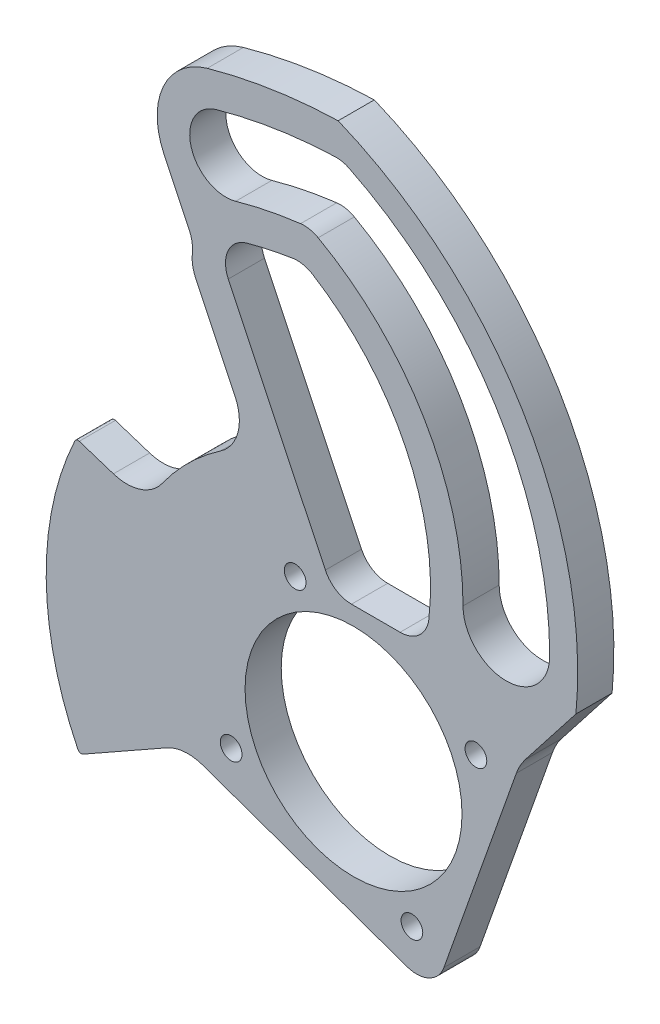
ISO-10303-21;
HEADER;
FILE_DESCRIPTION(('STEP AP214'),'2;1');
FILE_NAME('part.step','',(''),(''),'','','');
FILE_SCHEMA(('AUTOMOTIVE_DESIGN { 1 0 10303 214 1 1 1 1 }'));
ENDSEC;
DATA;
#1=APPLICATION_CONTEXT('core data for automotive mechanical design processes');
#2=APPLICATION_PROTOCOL_DEFINITION('international standard','automotive_design',2000,#1);
#3=PRODUCT_CONTEXT('',#1,'mechanical');
#4=PRODUCT('Part','Part','',(#3));
#5=PRODUCT_RELATED_PRODUCT_CATEGORY('part','',(#4));
#6=PRODUCT_DEFINITION_FORMATION('','',#4);
#7=PRODUCT_DEFINITION_CONTEXT('part definition',#1,'design');
#8=PRODUCT_DEFINITION('design','',#6,#7);
#9=PRODUCT_DEFINITION_SHAPE('','',#8);
#10=(LENGTH_UNIT() NAMED_UNIT(*) SI_UNIT(.MILLI.,.METRE.));
#11=(NAMED_UNIT(*) PLANE_ANGLE_UNIT() SI_UNIT($,.RADIAN.));
#12=(NAMED_UNIT(*) SI_UNIT($,.STERADIAN.) SOLID_ANGLE_UNIT());
#13=UNCERTAINTY_MEASURE_WITH_UNIT(LENGTH_MEASURE(1.E-05),#10,'distance_accuracy_value','');
#14=(GEOMETRIC_REPRESENTATION_CONTEXT(3) GLOBAL_UNCERTAINTY_ASSIGNED_CONTEXT((#13)) GLOBAL_UNIT_ASSIGNED_CONTEXT((#10,
#11,#12)) REPRESENTATION_CONTEXT('',''));
#15=CARTESIAN_POINT('',(0.,0.,0.));
#16=DIRECTION('',(0.,0.,1.));
#17=DIRECTION('',(1.,0.,0.));
#18=AXIS2_PLACEMENT_3D('',#15,#16,#17);
#19=CARTESIAN_POINT('',(-27.4137430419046,99.28487645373,10.));
#20=DIRECTION('',(0.,0.,-1.));
#21=DIRECTION('',(-1.,0.,0.));
#22=AXIS2_PLACEMENT_3D('',#19,#20,#21);
#23=CYLINDRICAL_SURFACE('',#22,8.);
#24=CARTESIAN_POINT('',(-27.4137430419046,99.28487645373,0.));
#25=DIRECTION('',(0.,0.,1.));
#26=DIRECTION('',(1.,0.,0.));
#27=AXIS2_PLACEMENT_3D('',#24,#25,#26);
#28=CIRCLE('',#27,8.);
#29=CARTESIAN_POINT('',(-34.6344253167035,95.8407876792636,0.));
#30=VERTEX_POINT('',#29);
#31=CARTESIAN_POINT('',(-29.5429658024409,106.996323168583,0.));
#32=VERTEX_POINT('',#31);
#33=EDGE_CURVE('E389',#30,#32,#28,.F.);
#34=ORIENTED_EDGE('',*,*,#33,.T.);
#35=DIRECTION('',(0.,0.,-1.));
#36=VECTOR('',#35,1.);
#37=CARTESIAN_POINT('',(-29.5429658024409,106.996323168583,10.));
#38=LINE('',#37,#36);
#39=CARTESIAN_POINT('',(-29.5429658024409,106.996323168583,10.));
#40=VERTEX_POINT('',#39);
#41=EDGE_CURVE('E11',#40,#32,#38,.T.);
#42=ORIENTED_EDGE('',*,*,#41,.F.);
#43=CARTESIAN_POINT('',(-27.4137430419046,99.28487645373,10.));
#44=DIRECTION('',(0.,0.,1.));
#45=DIRECTION('',(1.,0.,0.));
#46=AXIS2_PLACEMENT_3D('',#43,#44,#45);
#47=CIRCLE('',#46,8.);
#48=CARTESIAN_POINT('',(-34.6344253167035,95.8407876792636,10.));
#49=VERTEX_POINT('',#48);
#50=EDGE_CURVE('E587',#49,#40,#47,.F.);
#51=ORIENTED_EDGE('',*,*,#50,.F.);
#52=DIRECTION('',(0.,0.,-1.));
#53=VECTOR('',#52,1.);
#54=CARTESIAN_POINT('',(-34.6344253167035,95.8407876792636,10.));
#55=LINE('',#54,#53);
#56=EDGE_CURVE('E406',#49,#30,#55,.T.);
#57=ORIENTED_EDGE('',*,*,#56,.T.);
#58=EDGE_LOOP('',(#34,#42,#51,#57));
#59=FACE_BOUND('',#58,.T.);
#60=ADVANCED_FACE('F35',(#59),#23,.F.);
#61=CARTESIAN_POINT('',(0.,0.,10.));
#62=DIRECTION('',(0.,0.,-1.));
#63=DIRECTION('',(-1.,0.,0.));
#64=AXIS2_PLACEMENT_3D('',#61,#62,#63);
#65=CYLINDRICAL_SURFACE('',#64,111.);
#66=CARTESIAN_POINT('',(0.,0.,0.));
#67=DIRECTION('',(0.,0.,1.));
#68=DIRECTION('',(1.,0.,0.));
#69=AXIS2_PLACEMENT_3D('',#66,#67,#68);
#70=CIRCLE('',#69,111.);
#71=CARTESIAN_POINT('',(-16.744024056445,109.72983941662,0.));
#72=VERTEX_POINT('',#71);
#73=EDGE_CURVE('E392',#32,#72,#70,.F.);
#74=ORIENTED_EDGE('',*,*,#73,.T.);
#75=DIRECTION('',(0.,0.,-1.));
#76=VECTOR('',#75,1.);
#77=CARTESIAN_POINT('',(-16.744024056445,109.72983941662,10.));
#78=LINE('',#77,#76);
#79=CARTESIAN_POINT('',(-16.744024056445,109.72983941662,10.));
#80=VERTEX_POINT('',#79);
#81=EDGE_CURVE('E45',#80,#72,#78,.T.);
#82=ORIENTED_EDGE('',*,*,#81,.F.);
#83=CARTESIAN_POINT('',(0.,0.,10.));
#84=DIRECTION('',(0.,0.,1.));
#85=DIRECTION('',(1.,0.,0.));
#86=AXIS2_PLACEMENT_3D('',#83,#84,#85);
#87=CIRCLE('',#86,111.);
#88=EDGE_CURVE('E589',#40,#80,#87,.F.);
#89=ORIENTED_EDGE('',*,*,#88,.F.);
#90=ORIENTED_EDGE('',*,*,#41,.T.);
#91=EDGE_LOOP('',(#74,#82,#89,#90));
#92=FACE_BOUND('',#91,.T.);
#93=ADVANCED_FACE('F620',(#92),#65,.F.);
#94=CARTESIAN_POINT('',(-15.5372475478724,101.821382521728,10.));
#95=DIRECTION('',(0.,0.,-1.));
#96=DIRECTION('',(-1.,0.,0.));
#97=AXIS2_PLACEMENT_3D('',#94,#95,#96);
#98=CYLINDRICAL_SURFACE('',#97,7.99999999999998);
#99=CARTESIAN_POINT('',(-15.5372475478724,101.821382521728,0.));
#100=DIRECTION('',(0.,0.,1.));
#101=DIRECTION('',(1.,0.,0.));
#102=AXIS2_PLACEMENT_3D('',#99,#100,#101);
#103=CIRCLE('',#102,7.99999999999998);
#104=CARTESIAN_POINT('',(-11.3169361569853,108.617629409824,0.));
#105=VERTEX_POINT('',#104);
#106=EDGE_CURVE('E394',#72,#105,#103,.F.);
#107=ORIENTED_EDGE('',*,*,#106,.T.);
#108=DIRECTION('',(0.,0.,-1.));
#109=VECTOR('',#108,1.);
#110=CARTESIAN_POINT('',(-11.3169361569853,108.617629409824,10.));
#111=LINE('',#110,#109);
#112=CARTESIAN_POINT('',(-11.3169361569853,108.617629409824,10.));
#113=VERTEX_POINT('',#112);
#114=EDGE_CURVE('E413',#113,#105,#111,.T.);
#115=ORIENTED_EDGE('',*,*,#114,.F.);
#116=CARTESIAN_POINT('',(-15.5372475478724,101.821382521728,10.));
#117=DIRECTION('',(0.,0.,1.));
#118=DIRECTION('',(1.,0.,0.));
#119=AXIS2_PLACEMENT_3D('',#116,#117,#118);
#120=CIRCLE('',#119,7.99999999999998);
#121=EDGE_CURVE('E591',#80,#113,#120,.F.);
#122=ORIENTED_EDGE('',*,*,#121,.F.);
#123=ORIENTED_EDGE('',*,*,#81,.T.);
#124=EDGE_LOOP('',(#107,#115,#122,#123));
#125=FACE_BOUND('',#124,.T.);
#126=ADVANCED_FACE('F625',(#125),#98,.F.);
#127=CARTESIAN_POINT('',(-47.7171219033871,50.,10.));
#128=DIRECTION('',(0.,0.,-1.));
#129=DIRECTION('',(-1.,0.,0.));
#130=AXIS2_PLACEMENT_3D('',#127,#128,#129);
#131=CYLINDRICAL_SURFACE('',#130,69.);
#132=CARTESIAN_POINT('',(-47.7171219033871,50.,0.));
#133=DIRECTION('',(0.,0.,1.));
#134=DIRECTION('',(1.,0.,0.));
#135=AXIS2_PLACEMENT_3D('',#132,#133,#134);
#136=CIRCLE('',#135,69.);
#137=CARTESIAN_POINT('',(20.8270591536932,42.0819672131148,0.));
#138=VERTEX_POINT('',#137);
#139=EDGE_CURVE('E396',#105,#138,#136,.F.);
#140=ORIENTED_EDGE('',*,*,#139,.T.);
#141=DIRECTION('',(0.,0.,-1.));
#142=VECTOR('',#141,1.);
#143=CARTESIAN_POINT('',(20.8270591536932,42.0819672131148,10.));
#144=LINE('',#143,#142);
#145=CARTESIAN_POINT('',(20.8270591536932,42.0819672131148,10.));
#146=VERTEX_POINT('',#145);
#147=EDGE_CURVE('E411',#146,#138,#144,.T.);
#148=ORIENTED_EDGE('',*,*,#147,.F.);
#149=CARTESIAN_POINT('',(-47.7171219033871,50.,10.));
#150=DIRECTION('',(0.,0.,1.));
#151=DIRECTION('',(1.,0.,0.));
#152=AXIS2_PLACEMENT_3D('',#149,#150,#151);
#153=CIRCLE('',#152,69.);
#154=EDGE_CURVE('E593',#113,#146,#153,.F.);
#155=ORIENTED_EDGE('',*,*,#154,.F.);
#156=ORIENTED_EDGE('',*,*,#114,.T.);
#157=EDGE_LOOP('',(#140,#148,#155,#156));
#158=FACE_BOUND('',#157,.T.);
#159=ADVANCED_FACE('F825',(#158),#131,.F.);
#160=CARTESIAN_POINT('',(12.8799077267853,43.,10.));
#161=DIRECTION('',(0.,0.,-1.));
#162=DIRECTION('',(-1.,0.,0.));
#163=AXIS2_PLACEMENT_3D('',#160,#161,#162);
#164=CYLINDRICAL_SURFACE('',#163,7.99999999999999);
#165=CARTESIAN_POINT('',(12.8799077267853,43.,0.));
#166=DIRECTION('',(0.,0.,1.));
#167=DIRECTION('',(1.,0.,0.));
#168=AXIS2_PLACEMENT_3D('',#165,#166,#167);
#169=CIRCLE('',#168,7.99999999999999);
#170=CARTESIAN_POINT('',(12.8799077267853,35.,0.));
#171=VERTEX_POINT('',#170);
#172=EDGE_CURVE('E399',#171,#138,#169,.T.);
#173=ORIENTED_EDGE('',*,*,#172,.F.);
#174=DIRECTION('',(0.,0.,-1.));
#175=VECTOR('',#174,1.);
#176=CARTESIAN_POINT('',(12.8799077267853,35.,10.));
#177=LINE('',#176,#175);
#178=CARTESIAN_POINT('',(12.8799077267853,35.,10.));
#179=VERTEX_POINT('',#178);
#180=EDGE_CURVE('E300',#179,#171,#177,.T.);
#181=ORIENTED_EDGE('',*,*,#180,.F.);
#182=CARTESIAN_POINT('',(12.8799077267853,43.,10.));
#183=DIRECTION('',(0.,0.,1.));
#184=DIRECTION('',(1.,0.,0.));
#185=AXIS2_PLACEMENT_3D('',#182,#183,#184);
#186=CIRCLE('',#185,7.99999999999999);
#187=EDGE_CURVE('E293',#179,#146,#186,.T.);
#188=ORIENTED_EDGE('',*,*,#187,.T.);
#189=ORIENTED_EDGE('',*,*,#147,.T.);
#190=EDGE_LOOP('',(#173,#181,#188,#189));
#191=FACE_BOUND('',#190,.T.);
#192=ADVANCED_FACE('F596',(#191),#164,.F.);
#193=CARTESIAN_POINT('',(0.,35.,10.));
#194=DIRECTION('',(0.,-1.,0.));
#195=DIRECTION('',(0.,0.,-1.));
#196=AXIS2_PLACEMENT_3D('',#193,#194,#195);
#197=PLANE('',#196);
#198=DIRECTION('',(-1.,0.,0.));
#199=VECTOR('',#198,1.);
#200=CARTESIAN_POINT('',(0.,35.,0.));
#201=LINE('',#200,#199);
#202=CARTESIAN_POINT('',(-0.567234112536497,35.,0.));
#203=VERTEX_POINT('',#202);
#204=EDGE_CURVE('E299',#171,#203,#201,.T.);
#205=ORIENTED_EDGE('',*,*,#204,.T.);
#206=DIRECTION('',(0.,0.,-1.));
#207=VECTOR('',#206,1.);
#208=CARTESIAN_POINT('',(-0.567234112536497,35.,10.));
#209=LINE('',#208,#207);
#210=CARTESIAN_POINT('',(-0.567234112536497,35.,10.));
#211=VERTEX_POINT('',#210);
#212=EDGE_CURVE('E296',#211,#203,#209,.T.);
#213=ORIENTED_EDGE('',*,*,#212,.F.);
#214=DIRECTION('',(-1.,0.,0.));
#215=VECTOR('',#214,1.);
#216=CARTESIAN_POINT('',(0.,35.,10.));
#217=LINE('',#216,#215);
#218=EDGE_CURVE('E287',#179,#211,#217,.T.);
#219=ORIENTED_EDGE('',*,*,#218,.F.);
#220=ORIENTED_EDGE('',*,*,#180,.T.);
#221=EDGE_LOOP('',(#205,#213,#219,#220));
#222=FACE_BOUND('',#221,.T.);
#223=ADVANCED_FACE('F297',(#222),#197,.F.);
#224=CARTESIAN_POINT('',(-0.567234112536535,43.,10.));
#225=DIRECTION('',(0.,0.,-1.));
#226=DIRECTION('',(-1.,0.,0.));
#227=AXIS2_PLACEMENT_3D('',#224,#225,#226);
#228=CYLINDRICAL_SURFACE('',#227,8.);
#229=CARTESIAN_POINT('',(-0.567234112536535,43.,0.));
#230=DIRECTION('',(0.,0.,1.));
#231=DIRECTION('',(1.,0.,0.));
#232=AXIS2_PLACEMENT_3D('',#229,#230,#231);
#233=CIRCLE('',#232,8.);
#234=CARTESIAN_POINT('',(-7.78791638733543,39.5559112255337,0.));
#235=VERTEX_POINT('',#234);
#236=EDGE_CURVE('E170',#203,#235,#233,.F.);
#237=ORIENTED_EDGE('',*,*,#236,.T.);
#238=DIRECTION('',(0.,0.,-1.));
#239=VECTOR('',#238,1.);
#240=CARTESIAN_POINT('',(-7.78791638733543,39.5559112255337,10.));
#241=LINE('',#240,#239);
#242=CARTESIAN_POINT('',(-7.78791638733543,39.5559112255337,10.));
#243=VERTEX_POINT('',#242);
#244=EDGE_CURVE('E301',#243,#235,#241,.T.);
#245=ORIENTED_EDGE('',*,*,#244,.F.);
#246=CARTESIAN_POINT('',(-0.567234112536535,43.,10.));
#247=DIRECTION('',(0.,0.,1.));
#248=DIRECTION('',(1.,0.,0.));
#249=AXIS2_PLACEMENT_3D('',#246,#247,#248);
#250=CIRCLE('',#249,8.);
#251=EDGE_CURVE('E291',#211,#243,#250,.F.);
#252=ORIENTED_EDGE('',*,*,#251,.F.);
#253=ORIENTED_EDGE('',*,*,#212,.T.);
#254=EDGE_LOOP('',(#237,#245,#252,#253));
#255=FACE_BOUND('',#254,.T.);
#256=ADVANCED_FACE('F303',(#255),#228,.F.);
#257=CARTESIAN_POINT('',(34.5614111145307,-12.238837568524,10.));
#258=DIRECTION('',(-0.94264149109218,0.333806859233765,0.));
#259=DIRECTION('',(-0.333806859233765,-0.94264149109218,0.));
#260=AXIS2_PLACEMENT_3D('',#257,#258,#259);
#261=PLANE('',#260);
#262=DIRECTION('',(0.333806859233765,0.94264149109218,0.));
#263=VECTOR('',#262,1.);
#264=CARTESIAN_POINT('',(34.5614111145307,-12.238837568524,0.));
#265=LINE('',#264,#263);
#266=CARTESIAN_POINT('',(24.9930284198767,-39.2591167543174,0.));
#267=VERTEX_POINT('',#266);
#268=CARTESIAN_POINT('',(45.0214399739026,17.2993727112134,0.));
#269=VERTEX_POINT('',#268);
#270=EDGE_CURVE('E332',#267,#269,#265,.T.);
#271=ORIENTED_EDGE('',*,*,#270,.T.);
#272=DIRECTION('',(0.,0.,-1.));
#273=VECTOR('',#272,1.);
#274=CARTESIAN_POINT('',(45.0214399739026,17.2993727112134,10.));
#275=LINE('',#274,#273);
#276=CARTESIAN_POINT('',(45.0214399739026,17.2993727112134,10.));
#277=VERTEX_POINT('',#276);
#278=EDGE_CURVE('E408',#277,#269,#275,.T.);
#279=ORIENTED_EDGE('',*,*,#278,.F.);
#280=DIRECTION('',(0.333806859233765,0.94264149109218,0.));
#281=VECTOR('',#280,1.);
#282=CARTESIAN_POINT('',(34.5614111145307,-12.238837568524,10.));
#283=LINE('',#282,#281);
#284=CARTESIAN_POINT('',(24.9930284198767,-39.2591167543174,10.));
#285=VERTEX_POINT('',#284);
#286=EDGE_CURVE('E533',#285,#277,#283,.T.);
#287=ORIENTED_EDGE('',*,*,#286,.F.);
#288=DIRECTION('',(0.,0.,-1.));
#289=VECTOR('',#288,1.);
#290=CARTESIAN_POINT('',(24.9930284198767,-39.2591167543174,10.));
#291=LINE('',#290,#289);
#292=EDGE_CURVE('E418',#285,#267,#291,.T.);
#293=ORIENTED_EDGE('',*,*,#292,.T.);
#294=EDGE_LOOP('',(#271,#279,#287,#293));
#295=FACE_BOUND('',#294,.T.);
#296=ADVANCED_FACE('F708',(#295),#261,.F.);
#297=CARTESIAN_POINT('',(60.1037038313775,11.9584629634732,10.));
#298=DIRECTION('',(0.,0.,-1.));
#299=DIRECTION('',(-1.,0.,0.));
#300=AXIS2_PLACEMENT_3D('',#297,#298,#299);
#301=CYLINDRICAL_SURFACE('',#300,16.);
#302=CARTESIAN_POINT('',(60.1037038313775,11.9584629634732,0.));
#303=DIRECTION('',(0.,0.,1.));
#304=DIRECTION('',(1.,0.,0.));
#305=AXIS2_PLACEMENT_3D('',#302,#303,#304);
#306=CIRCLE('',#305,16.);
#307=CARTESIAN_POINT('',(47.4955317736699,21.8090465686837,0.));
#308=VERTEX_POINT('',#307);
#309=EDGE_CURVE('E335',#269,#308,#306,.F.);
#310=ORIENTED_EDGE('',*,*,#309,.T.);
#311=DIRECTION('',(0.,0.,-1.));
#312=VECTOR('',#311,1.);
#313=CARTESIAN_POINT('',(47.4955317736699,21.8090465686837,10.));
#314=LINE('',#313,#312);
#315=CARTESIAN_POINT('',(47.4955317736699,21.8090465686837,10.));
#316=VERTEX_POINT('',#315);
#317=EDGE_CURVE('E461',#316,#308,#314,.T.);
#318=ORIENTED_EDGE('',*,*,#317,.F.);
#319=CARTESIAN_POINT('',(60.1037038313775,11.9584629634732,10.));
#320=DIRECTION('',(0.,0.,1.));
#321=DIRECTION('',(1.,0.,0.));
#322=AXIS2_PLACEMENT_3D('',#319,#320,#321);
#323=CIRCLE('',#322,16.);
#324=EDGE_CURVE('E536',#277,#316,#323,.F.);
#325=ORIENTED_EDGE('',*,*,#324,.F.);
#326=ORIENTED_EDGE('',*,*,#278,.T.);
#327=EDGE_LOOP('',(#310,#318,#325,#326));
#328=FACE_BOUND('',#327,.T.);
#329=ADVANCED_FACE('F704',(#328),#301,.F.);
#330=CARTESIAN_POINT('',(18.9122580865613,-14.7758754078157,10.));
#331=DIRECTION('',(-0.788010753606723,0.615661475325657,0.));
#332=DIRECTION('',(-0.615661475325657,-0.788010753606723,0.));
#333=AXIS2_PLACEMENT_3D('',#330,#331,#332);
#334=PLANE('',#333);
#335=DIRECTION('',(0.615661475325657,0.788010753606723,0.));
#336=VECTOR('',#335,1.);
#337=CARTESIAN_POINT('',(18.9122580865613,-14.7758754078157,0.));
#338=LINE('',#337,#336);
#339=CARTESIAN_POINT('',(61.5072731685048,39.743257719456,0.));
#340=VERTEX_POINT('',#339);
#341=EDGE_CURVE('E337',#308,#340,#338,.T.);
#342=ORIENTED_EDGE('',*,*,#341,.T.);
#343=DIRECTION('',(0.,0.,-1.));
#344=VECTOR('',#343,1.);
#345=CARTESIAN_POINT('',(61.5072731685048,39.743257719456,10.));
#346=LINE('',#345,#344);
#347=CARTESIAN_POINT('',(61.5072731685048,39.743257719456,10.));
#348=VERTEX_POINT('',#347);
#349=EDGE_CURVE('E459',#348,#340,#346,.T.);
#350=ORIENTED_EDGE('',*,*,#349,.F.);
#351=DIRECTION('',(0.615661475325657,0.788010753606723,0.));
#352=VECTOR('',#351,1.);
#353=CARTESIAN_POINT('',(18.9122580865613,-14.7758754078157,10.));
#354=LINE('',#353,#352);
#355=EDGE_CURVE('E538',#316,#348,#354,.T.);
#356=ORIENTED_EDGE('',*,*,#355,.F.);
#357=ORIENTED_EDGE('',*,*,#317,.T.);
#358=EDGE_LOOP('',(#342,#350,#356,#357));
#359=FACE_BOUND('',#358,.T.);
#360=ADVANCED_FACE('F700',(#359),#334,.F.);
#361=CARTESIAN_POINT('',(-45.,50.,10.));
#362=DIRECTION('',(0.,0.,-1.));
#363=DIRECTION('',(-1.,0.,0.));
#364=AXIS2_PLACEMENT_3D('',#361,#362,#363);
#365=CYLINDRICAL_SURFACE('',#364,107.);
#366=CARTESIAN_POINT('',(-45.,50.,0.));
#367=DIRECTION('',(0.,0.,1.));
#368=DIRECTION('',(1.,0.,0.));
#369=AXIS2_PLACEMENT_3D('',#366,#367,#368);
#370=CIRCLE('',#369,107.);
#371=CARTESIAN_POINT('',(-4.25645452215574,148.93919093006,0.));
#372=VERTEX_POINT('',#371);
#373=EDGE_CURVE('E340',#372,#340,#370,.F.);
#374=ORIENTED_EDGE('',*,*,#373,.F.);
#375=DIRECTION('',(0.,0.,-1.));
#376=VECTOR('',#375,1.);
#377=CARTESIAN_POINT('',(-4.25645452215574,148.93919093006,10.));
#378=LINE('',#377,#376);
#379=CARTESIAN_POINT('',(-4.25645452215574,148.93919093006,10.));
#380=VERTEX_POINT('',#379);
#381=EDGE_CURVE('E457',#380,#372,#378,.T.);
#382=ORIENTED_EDGE('',*,*,#381,.F.);
#383=CARTESIAN_POINT('',(-45.,50.,10.));
#384=DIRECTION('',(0.,0.,1.));
#385=DIRECTION('',(1.,0.,0.));
#386=AXIS2_PLACEMENT_3D('',#383,#384,#385);
#387=CIRCLE('',#386,107.);
#388=EDGE_CURVE('E540',#380,#348,#387,.F.);
#389=ORIENTED_EDGE('',*,*,#388,.T.);
#390=ORIENTED_EDGE('',*,*,#349,.T.);
#391=EDGE_LOOP('',(#374,#382,#389,#390));
#392=FACE_BOUND('',#391,.T.);
#393=ADVANCED_FACE('F696',(#392),#365,.T.);
#394=CARTESIAN_POINT('',(0.,0.,10.));
#395=DIRECTION('',(0.,0.,-1.));
#396=DIRECTION('',(-1.,0.,0.));
#397=AXIS2_PLACEMENT_3D('',#394,#395,#396);
#398=CYLINDRICAL_SURFACE('',#397,149.);
#399=CARTESIAN_POINT('',(0.,0.,0.));
#400=DIRECTION('',(0.,0.,1.));
#401=DIRECTION('',(1.,0.,0.));
#402=AXIS2_PLACEMENT_3D('',#399,#400,#401);
#403=CIRCLE('',#402,149.);
#404=CARTESIAN_POINT('',(-40.4619033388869,143.400956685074,0.));
#405=VERTEX_POINT('',#404);
#406=EDGE_CURVE('E343',#372,#405,#403,.T.);
#407=ORIENTED_EDGE('',*,*,#406,.T.);
#408=DIRECTION('',(0.,0.,-1.));
#409=VECTOR('',#408,1.);
#410=CARTESIAN_POINT('',(-40.4619033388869,143.400956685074,10.));
#411=LINE('',#410,#409);
#412=CARTESIAN_POINT('',(-40.4619033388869,143.400956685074,10.));
#413=VERTEX_POINT('',#412);
#414=EDGE_CURVE('E455',#413,#405,#411,.T.);
#415=ORIENTED_EDGE('',*,*,#414,.F.);
#416=CARTESIAN_POINT('',(0.,0.,10.));
#417=DIRECTION('',(0.,0.,1.));
#418=DIRECTION('',(1.,0.,0.));
#419=AXIS2_PLACEMENT_3D('',#416,#417,#418);
#420=CIRCLE('',#419,149.);
#421=EDGE_CURVE('E543',#380,#413,#420,.T.);
#422=ORIENTED_EDGE('',*,*,#421,.F.);
#423=ORIENTED_EDGE('',*,*,#381,.T.);
#424=EDGE_LOOP('',(#407,#415,#422,#423));
#425=FACE_BOUND('',#424,.T.);
#426=ADVANCED_FACE('F692',(#425),#398,.T.);
#427=CARTESIAN_POINT('',(-35.3023317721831,125.114928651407,10.));
#428=DIRECTION('',(0.,0.,-1.));
#429=DIRECTION('',(-1.,0.,0.));
#430=AXIS2_PLACEMENT_3D('',#427,#428,#429);
#431=CYLINDRICAL_SURFACE('',#430,19.);
#432=CARTESIAN_POINT('',(-35.3023317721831,125.114928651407,0.));
#433=DIRECTION('',(0.,0.,1.));
#434=DIRECTION('',(1.,0.,0.));
#435=AXIS2_PLACEMENT_3D('',#432,#433,#434);
#436=CIRCLE('',#435,19.);
#437=CARTESIAN_POINT('',(-52.4514521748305,116.93521781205,0.));
#438=VERTEX_POINT('',#437);
#439=EDGE_CURVE('E346',#438,#405,#436,.F.);
#440=ORIENTED_EDGE('',*,*,#439,.F.);
#441=DIRECTION('',(0.,0.,-1.));
#442=VECTOR('',#441,1.);
#443=CARTESIAN_POINT('',(-52.4514521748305,116.93521781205,10.));
#444=LINE('',#443,#442);
#445=CARTESIAN_POINT('',(-52.4514521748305,116.93521781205,10.));
#446=VERTEX_POINT('',#445);
#447=EDGE_CURVE('E453',#446,#438,#444,.T.);
#448=ORIENTED_EDGE('',*,*,#447,.F.);
#449=CARTESIAN_POINT('',(-35.3023317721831,125.114928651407,10.));
#450=DIRECTION('',(0.,0.,1.));
#451=DIRECTION('',(1.,0.,0.));
#452=AXIS2_PLACEMENT_3D('',#449,#450,#451);
#453=CIRCLE('',#452,19.);
#454=EDGE_CURVE('E545',#446,#413,#453,.F.);
#455=ORIENTED_EDGE('',*,*,#454,.T.);
#456=ORIENTED_EDGE('',*,*,#414,.T.);
#457=EDGE_LOOP('',(#440,#448,#455,#456));
#458=FACE_BOUND('',#457,.T.);
#459=ADVANCED_FACE('F688',(#458),#431,.T.);
#460=CARTESIAN_POINT('',(2.70775585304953,1.29153329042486,10.));
#461=DIRECTION('',(-0.90258528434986,-0.430511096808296,0.));
#462=DIRECTION('',(0.430511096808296,-0.90258528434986,0.));
#463=AXIS2_PLACEMENT_3D('',#460,#461,#462);
#464=PLANE('',#463);
#465=DIRECTION('',(-0.430511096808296,0.90258528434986,0.));
#466=VECTOR('',#465,1.);
#467=CARTESIAN_POINT('',(2.70775585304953,1.29153329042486,0.));
#468=LINE('',#467,#466);
#469=CARTESIAN_POINT('',(-45.4921865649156,102.344814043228,0.));
#470=VERTEX_POINT('',#469);
#471=EDGE_CURVE('E349',#470,#438,#468,.T.);
#472=ORIENTED_EDGE('',*,*,#471,.F.);
#473=DIRECTION('',(0.,0.,-1.));
#474=VECTOR('',#473,1.);
#475=CARTESIAN_POINT('',(-45.4921865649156,102.344814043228,10.));
#476=LINE('',#475,#474);
#477=CARTESIAN_POINT('',(-45.4921865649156,102.344814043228,10.));
#478=VERTEX_POINT('',#477);
#479=EDGE_CURVE('E451',#478,#470,#476,.T.);
#480=ORIENTED_EDGE('',*,*,#479,.F.);
#481=DIRECTION('',(-0.430511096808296,0.90258528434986,0.));
#482=VECTOR('',#481,1.);
#483=CARTESIAN_POINT('',(2.70775585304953,1.29153329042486,10.));
#484=LINE('',#483,#482);
#485=EDGE_CURVE('E548',#478,#446,#484,.T.);
#486=ORIENTED_EDGE('',*,*,#485,.T.);
#487=ORIENTED_EDGE('',*,*,#447,.T.);
#488=EDGE_LOOP('',(#472,#480,#486,#487));
#489=FACE_BOUND('',#488,.T.);
#490=ADVANCED_FACE('F684',(#489),#464,.T.);
#491=CARTESIAN_POINT('',(-54.5180394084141,98.039703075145,10.));
#492=DIRECTION('',(0.,0.,-1.));
#493=DIRECTION('',(-1.,0.,0.));
#494=AXIS2_PLACEMENT_3D('',#491,#492,#493);
#495=CYLINDRICAL_SURFACE('',#494,10.);
#496=CARTESIAN_POINT('',(-54.5180394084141,98.039703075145,0.));
#497=DIRECTION('',(0.,0.,1.));
#498=DIRECTION('',(1.,0.,0.));
#499=AXIS2_PLACEMENT_3D('',#496,#497,#498);
#500=CIRCLE('',#499,10.);
#501=CARTESIAN_POINT('',(-44.5782065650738,96.9443843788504,0.));
#502=VERTEX_POINT('',#501);
#503=EDGE_CURVE('E352',#502,#470,#500,.T.);
#504=ORIENTED_EDGE('',*,*,#503,.F.);
#505=DIRECTION('',(0.,0.,-1.));
#506=VECTOR('',#505,1.);
#507=CARTESIAN_POINT('',(-44.5782065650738,96.9443843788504,10.));
#508=LINE('',#507,#506);
#509=CARTESIAN_POINT('',(-44.5782065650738,96.9443843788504,10.));
#510=VERTEX_POINT('',#509);
#511=EDGE_CURVE('E449',#510,#502,#508,.T.);
#512=ORIENTED_EDGE('',*,*,#511,.F.);
#513=CARTESIAN_POINT('',(-54.5180394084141,98.039703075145,10.));
#514=DIRECTION('',(0.,0.,1.));
#515=DIRECTION('',(1.,0.,0.));
#516=AXIS2_PLACEMENT_3D('',#513,#514,#515);
#517=CIRCLE('',#516,10.);
#518=EDGE_CURVE('E551',#510,#478,#517,.T.);
#519=ORIENTED_EDGE('',*,*,#518,.T.);
#520=ORIENTED_EDGE('',*,*,#479,.T.);
#521=EDGE_LOOP('',(#504,#512,#519,#520));
#522=FACE_BOUND('',#521,.T.);
#523=ADVANCED_FACE('F680',(#522),#495,.F.);
#524=CARTESIAN_POINT('',(-34.6383737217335,95.8490656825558,10.));
#525=DIRECTION('',(0.,0.,-1.));
#526=DIRECTION('',(-1.,0.,0.));
#527=AXIS2_PLACEMENT_3D('',#524,#525,#526);
#528=CYLINDRICAL_SURFACE('',#527,9.99999999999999);
#529=CARTESIAN_POINT('',(-34.6383737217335,95.8490656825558,0.));
#530=DIRECTION('',(0.,0.,1.));
#531=DIRECTION('',(1.,0.,0.));
#532=AXIS2_PLACEMENT_3D('',#529,#530,#531);
#533=CIRCLE('',#532,9.99999999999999);
#534=CARTESIAN_POINT('',(-43.664226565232,91.5439547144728,0.));
#535=VERTEX_POINT('',#534);
#536=EDGE_CURVE('E355',#535,#502,#533,.F.);
#537=ORIENTED_EDGE('',*,*,#536,.F.);
#538=DIRECTION('',(0.,0.,-1.));
#539=VECTOR('',#538,1.);
#540=CARTESIAN_POINT('',(-43.664226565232,91.5439547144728,10.));
#541=LINE('',#540,#539);
#542=CARTESIAN_POINT('',(-43.664226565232,91.5439547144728,10.));
#543=VERTEX_POINT('',#542);
#544=EDGE_CURVE('E447',#543,#535,#541,.T.);
#545=ORIENTED_EDGE('',*,*,#544,.F.);
#546=CARTESIAN_POINT('',(-34.6383737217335,95.8490656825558,10.));
#547=DIRECTION('',(0.,0.,1.));
#548=DIRECTION('',(1.,0.,0.));
#549=AXIS2_PLACEMENT_3D('',#546,#547,#548);
#550=CIRCLE('',#549,9.99999999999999);
#551=EDGE_CURVE('E554',#543,#510,#550,.F.);
#552=ORIENTED_EDGE('',*,*,#551,.T.);
#553=ORIENTED_EDGE('',*,*,#511,.T.);
#554=EDGE_LOOP('',(#537,#545,#552,#553));
#555=FACE_BOUND('',#554,.T.);
#556=ADVANCED_FACE('F676',(#555),#528,.T.);
#557=CARTESIAN_POINT('',(0.,0.,10.));
#558=DIRECTION('',(-0.90258528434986,-0.430511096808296,0.));
#559=DIRECTION('',(0.430511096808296,-0.90258528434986,0.));
#560=AXIS2_PLACEMENT_3D('',#557,#558,#559);
#561=PLANE('',#560);
#562=DIRECTION('',(-0.430511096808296,0.90258528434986,0.));
#563=VECTOR('',#562,1.);
#564=CARTESIAN_POINT('',(0.,0.,0.));
#565=LINE('',#564,#563);
#566=CARTESIAN_POINT('',(-32.7443242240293,68.6499033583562,0.));
#567=VERTEX_POINT('',#566);
#568=EDGE_CURVE('E358',#567,#535,#565,.T.);
#569=ORIENTED_EDGE('',*,*,#568,.F.);
#570=DIRECTION('',(0.,0.,-1.));
#571=VECTOR('',#570,1.);
#572=CARTESIAN_POINT('',(-32.7443242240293,68.6499033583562,10.));
#573=LINE('',#572,#571);
#574=CARTESIAN_POINT('',(-32.7443242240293,68.6499033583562,10.));
#575=VERTEX_POINT('',#574);
#576=EDGE_CURVE('E445',#575,#567,#573,.T.);
#577=ORIENTED_EDGE('',*,*,#576,.F.);
#578=DIRECTION('',(-0.430511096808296,0.90258528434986,0.));
#579=VECTOR('',#578,1.);
#580=CARTESIAN_POINT('',(0.,0.,10.));
#581=LINE('',#580,#579);
#582=EDGE_CURVE('E557',#575,#543,#581,.T.);
#583=ORIENTED_EDGE('',*,*,#582,.T.);
#584=ORIENTED_EDGE('',*,*,#544,.T.);
#585=EDGE_LOOP('',(#569,#577,#583,#584));
#586=FACE_BOUND('',#585,.T.);
#587=ADVANCED_FACE('F672',(#586),#561,.T.);
#588=CARTESIAN_POINT('',(-43.5753476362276,63.4837701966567,10.));
#589=DIRECTION('',(0.,0.,-1.));
#590=DIRECTION('',(-1.,0.,0.));
#591=AXIS2_PLACEMENT_3D('',#588,#589,#590);
#592=CYLINDRICAL_SURFACE('',#591,12.);
#593=CARTESIAN_POINT('',(-43.5753476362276,63.4837701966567,0.));
#594=DIRECTION('',(0.,0.,1.));
#595=DIRECTION('',(1.,0.,0.));
#596=AXIS2_PLACEMENT_3D('',#593,#594,#595);
#597=CIRCLE('',#596,12.);
#598=CARTESIAN_POINT('',(-36.7843843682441,53.5901956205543,0.));
#599=VERTEX_POINT('',#598);
#600=EDGE_CURVE('E361',#599,#567,#597,.T.);
#601=ORIENTED_EDGE('',*,*,#600,.F.);
#602=DIRECTION('',(0.,0.,-1.));
#603=VECTOR('',#602,1.);
#604=CARTESIAN_POINT('',(-36.7843843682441,53.5901956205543,10.));
#605=LINE('',#604,#603);
#606=CARTESIAN_POINT('',(-36.7843843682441,53.5901956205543,10.));
#607=VERTEX_POINT('',#606);
#608=EDGE_CURVE('E443',#607,#599,#605,.T.);
#609=ORIENTED_EDGE('',*,*,#608,.F.);
#610=CARTESIAN_POINT('',(-43.5753476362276,63.4837701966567,10.));
#611=DIRECTION('',(0.,0.,1.));
#612=DIRECTION('',(1.,0.,0.));
#613=AXIS2_PLACEMENT_3D('',#610,#611,#612);
#614=CIRCLE('',#613,12.);
#615=EDGE_CURVE('E560',#607,#575,#614,.T.);
#616=ORIENTED_EDGE('',*,*,#615,.T.);
#617=ORIENTED_EDGE('',*,*,#576,.T.);
#618=EDGE_LOOP('',(#601,#609,#616,#617));
#619=FACE_BOUND('',#618,.T.);
#620=ADVANCED_FACE('F668',(#619),#592,.F.);
#621=CARTESIAN_POINT('',(0.,0.,10.));
#622=DIRECTION('',(0.,0.,-1.));
#623=DIRECTION('',(-1.,0.,0.));
#624=AXIS2_PLACEMENT_3D('',#621,#622,#623);
#625=CYLINDRICAL_SURFACE('',#624,65.);
#626=CARTESIAN_POINT('',(0.,0.,0.));
#627=DIRECTION('',(0.,0.,1.));
#628=DIRECTION('',(1.,0.,0.));
#629=AXIS2_PLACEMENT_3D('',#626,#627,#628);
#630=CIRCLE('',#629,65.);
#631=CARTESIAN_POINT('',(-52.9176365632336,37.7455128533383,0.));
#632=VERTEX_POINT('',#631);
#633=EDGE_CURVE('E364',#632,#599,#630,.F.);
#634=ORIENTED_EDGE('',*,*,#633,.F.);
#635=DIRECTION('',(0.,0.,-1.));
#636=VECTOR('',#635,1.);
#637=CARTESIAN_POINT('',(-52.9176365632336,37.7455128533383,10.));
#638=LINE('',#637,#636);
#639=CARTESIAN_POINT('',(-52.9176365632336,37.7455128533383,10.));
#640=VERTEX_POINT('',#639);
#641=EDGE_CURVE('E441',#640,#632,#638,.T.);
#642=ORIENTED_EDGE('',*,*,#641,.F.);
#643=CARTESIAN_POINT('',(0.,0.,10.));
#644=DIRECTION('',(0.,0.,1.));
#645=DIRECTION('',(1.,0.,0.));
#646=AXIS2_PLACEMENT_3D('',#643,#644,#645);
#647=CIRCLE('',#646,65.);
#648=EDGE_CURVE('E563',#640,#607,#647,.F.);
#649=ORIENTED_EDGE('',*,*,#648,.T.);
#650=ORIENTED_EDGE('',*,*,#608,.T.);
#651=EDGE_LOOP('',(#634,#642,#649,#650));
#652=FACE_BOUND('',#651,.T.);
#653=ADVANCED_FACE('F664',(#652),#625,.T.);
#654=CARTESIAN_POINT('',(-62.6870463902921,44.7139152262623,10.));
#655=DIRECTION('',(0.,0.,-1.));
#656=DIRECTION('',(-1.,0.,0.));
#657=AXIS2_PLACEMENT_3D('',#654,#655,#656);
#658=CYLINDRICAL_SURFACE('',#657,12.);
#659=CARTESIAN_POINT('',(-62.6870463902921,44.7139152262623,0.));
#660=DIRECTION('',(0.,0.,1.));
#661=DIRECTION('',(1.,0.,0.));
#662=AXIS2_PLACEMENT_3D('',#659,#660,#661);
#663=CIRCLE('',#662,12.);
#664=CARTESIAN_POINT('',(-66.3952503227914,33.3012370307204,0.));
#665=VERTEX_POINT('',#664);
#666=EDGE_CURVE('E367',#665,#632,#663,.T.);
#667=ORIENTED_EDGE('',*,*,#666,.F.);
#668=DIRECTION('',(0.,0.,-1.));
#669=VECTOR('',#668,1.);
#670=CARTESIAN_POINT('',(-66.3952503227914,33.3012370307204,10.));
#671=LINE('',#670,#669);
#672=CARTESIAN_POINT('',(-66.3952503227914,33.3012370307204,10.));
#673=VERTEX_POINT('',#672);
#674=EDGE_CURVE('E439',#673,#665,#671,.T.);
#675=ORIENTED_EDGE('',*,*,#674,.F.);
#676=CARTESIAN_POINT('',(-62.6870463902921,44.7139152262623,10.));
#677=DIRECTION('',(0.,0.,1.));
#678=DIRECTION('',(1.,0.,0.));
#679=AXIS2_PLACEMENT_3D('',#676,#677,#678);
#680=CIRCLE('',#679,12.);
#681=EDGE_CURVE('E566',#673,#640,#680,.T.);
#682=ORIENTED_EDGE('',*,*,#681,.T.);
#683=ORIENTED_EDGE('',*,*,#641,.T.);
#684=EDGE_LOOP('',(#667,#675,#682,#683));
#685=FACE_BOUND('',#684,.T.);
#686=ADVANCED_FACE('F660',(#685),#658,.F.);
#687=CARTESIAN_POINT('',(3.44680577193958,10.6081773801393,10.));
#688=DIRECTION('',(0.309016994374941,0.951056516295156,0.));
#689=DIRECTION('',(-0.951056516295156,0.309016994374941,0.));
#690=AXIS2_PLACEMENT_3D('',#687,#688,#689);
#691=PLANE('',#690);
#692=DIRECTION('',(0.951056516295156,-0.309016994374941,0.));
#693=VECTOR('',#692,1.);
#694=CARTESIAN_POINT('',(3.44680577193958,10.6081773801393,0.));
#695=LINE('',#694,#693);
#696=CARTESIAN_POINT('',(-75.8561069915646,36.3752557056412,0.));
#697=VERTEX_POINT('',#696);
#698=EDGE_CURVE('E370',#697,#665,#695,.T.);
#699=ORIENTED_EDGE('',*,*,#698,.F.);
#700=DIRECTION('',(0.,0.,-1.));
#701=VECTOR('',#700,1.);
#702=CARTESIAN_POINT('',(-75.8561069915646,36.3752557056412,10.));
#703=LINE('',#702,#701);
#704=CARTESIAN_POINT('',(-75.8561069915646,36.3752557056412,10.));
#705=VERTEX_POINT('',#704);
#706=EDGE_CURVE('E437',#705,#697,#703,.T.);
#707=ORIENTED_EDGE('',*,*,#706,.F.);
#708=DIRECTION('',(0.951056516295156,-0.309016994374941,0.));
#709=VECTOR('',#708,1.);
#710=CARTESIAN_POINT('',(3.44680577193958,10.6081773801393,10.));
#711=LINE('',#710,#709);
#712=EDGE_CURVE('E569',#705,#673,#711,.T.);
#713=ORIENTED_EDGE('',*,*,#712,.T.);
#714=ORIENTED_EDGE('',*,*,#674,.T.);
#715=EDGE_LOOP('',(#699,#707,#713,#714));
#716=FACE_BOUND('',#715,.T.);
#717=ADVANCED_FACE('F656',(#716),#691,.T.);
#718=CARTESIAN_POINT('',(-76.1651239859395,35.424199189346,10.));
#719=DIRECTION('',(0.,0.,-1.));
#720=DIRECTION('',(-1.,0.,0.));
#721=AXIS2_PLACEMENT_3D('',#718,#719,#720);
#722=CYLINDRICAL_SURFACE('',#721,0.999999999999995);
#723=CARTESIAN_POINT('',(-76.1651239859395,35.424199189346,0.));
#724=DIRECTION('',(0.,0.,1.));
#725=DIRECTION('',(1.,0.,0.));
#726=AXIS2_PLACEMENT_3D('',#723,#724,#725);
#727=CIRCLE('',#726,0.999999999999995);
#728=CARTESIAN_POINT('',(-77.0718516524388,35.8459158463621,0.));
#729=VERTEX_POINT('',#728);
#730=EDGE_CURVE('E373',#697,#729,#727,.T.);
#731=ORIENTED_EDGE('',*,*,#730,.T.);
#732=DIRECTION('',(0.,0.,-1.));
#733=VECTOR('',#732,1.);
#734=CARTESIAN_POINT('',(-77.0718516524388,35.8459158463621,10.));
#735=LINE('',#734,#733);
#736=CARTESIAN_POINT('',(-77.0718516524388,35.8459158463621,10.));
#737=VERTEX_POINT('',#736);
#738=EDGE_CURVE('E434',#737,#729,#735,.T.);
#739=ORIENTED_EDGE('',*,*,#738,.F.);
#740=CARTESIAN_POINT('',(-76.1651239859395,35.424199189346,10.));
#741=DIRECTION('',(0.,0.,1.));
#742=DIRECTION('',(1.,0.,0.));
#743=AXIS2_PLACEMENT_3D('',#740,#741,#742);
#744=CIRCLE('',#743,0.999999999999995);
#745=EDGE_CURVE('E572',#705,#737,#744,.T.);
#746=ORIENTED_EDGE('',*,*,#745,.F.);
#747=ORIENTED_EDGE('',*,*,#706,.T.);
#748=EDGE_LOOP('',(#731,#739,#746,#747));
#749=FACE_BOUND('',#748,.T.);
#750=ADVANCED_FACE('F652',(#749),#722,.T.);
#751=CARTESIAN_POINT('',(0.,0.,10.));
#752=DIRECTION('',(0.,0.,-1.));
#753=DIRECTION('',(-1.,0.,0.));
#754=AXIS2_PLACEMENT_3D('',#751,#752,#753);
#755=CYLINDRICAL_SURFACE('',#754,85.);
#756=CARTESIAN_POINT('',(0.,0.,0.));
#757=DIRECTION('',(0.,0.,1.));
#758=DIRECTION('',(1.,0.,0.));
#759=AXIS2_PLACEMENT_3D('',#756,#757,#758);
#760=CIRCLE('',#759,85.);
#761=CARTESIAN_POINT('',(-76.2163893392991,-37.6305991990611,0.));
#762=VERTEX_POINT('',#761);
#763=EDGE_CURVE('E375',#729,#762,#760,.T.);
#764=ORIENTED_EDGE('',*,*,#763,.T.);
#765=DIRECTION('',(0.,0.,-1.));
#766=VECTOR('',#765,1.);
#767=CARTESIAN_POINT('',(-76.2163893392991,-37.6305991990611,10.));
#768=LINE('',#767,#766);
#769=CARTESIAN_POINT('',(-76.2163893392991,-37.6305991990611,10.));
#770=VERTEX_POINT('',#769);
#771=EDGE_CURVE('E432',#770,#762,#768,.T.);
#772=ORIENTED_EDGE('',*,*,#771,.F.);
#773=CARTESIAN_POINT('',(0.,0.,10.));
#774=DIRECTION('',(0.,0.,1.));
#775=DIRECTION('',(1.,0.,0.));
#776=AXIS2_PLACEMENT_3D('',#773,#774,#775);
#777=CIRCLE('',#776,85.);
#778=EDGE_CURVE('E574',#737,#770,#777,.T.);
#779=ORIENTED_EDGE('',*,*,#778,.F.);
#780=ORIENTED_EDGE('',*,*,#738,.T.);
#781=EDGE_LOOP('',(#764,#772,#779,#780));
#782=FACE_BOUND('',#781,.T.);
#783=ADVANCED_FACE('F648',(#782),#755,.T.);
#784=CARTESIAN_POINT('',(-75.3197259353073,-37.1878862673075,10.));
#785=DIRECTION('',(0.,0.,-1.));
#786=DIRECTION('',(-1.,0.,0.));
#787=AXIS2_PLACEMENT_3D('',#784,#785,#786);
#788=CYLINDRICAL_SURFACE('',#787,0.99999999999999);
#789=CARTESIAN_POINT('',(-75.3197259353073,-37.1878862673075,0.));
#790=DIRECTION('',(0.,0.,1.));
#791=DIRECTION('',(1.,0.,0.));
#792=AXIS2_PLACEMENT_3D('',#789,#790,#791);
#793=CIRCLE('',#792,0.99999999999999);
#794=CARTESIAN_POINT('',(-74.8273023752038,-38.0582419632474,0.));
#795=VERTEX_POINT('',#794);
#796=EDGE_CURVE('E378',#795,#762,#793,.F.);
#797=ORIENTED_EDGE('',*,*,#796,.F.);
#798=DIRECTION('',(0.,0.,-1.));
#799=VECTOR('',#798,1.);
#800=CARTESIAN_POINT('',(-74.8273023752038,-38.0582419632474,10.));
#801=LINE('',#800,#799);
#802=CARTESIAN_POINT('',(-74.8273023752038,-38.0582419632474,10.));
#803=VERTEX_POINT('',#802);
#804=EDGE_CURVE('E430',#803,#795,#801,.T.);
#805=ORIENTED_EDGE('',*,*,#804,.F.);
#806=CARTESIAN_POINT('',(-75.3197259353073,-37.1878862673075,10.));
#807=DIRECTION('',(0.,0.,1.));
#808=DIRECTION('',(1.,0.,0.));
#809=AXIS2_PLACEMENT_3D('',#806,#807,#808);
#810=CIRCLE('',#809,0.99999999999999);
#811=EDGE_CURVE('E576',#803,#770,#810,.F.);
#812=ORIENTED_EDGE('',*,*,#811,.T.);
#813=ORIENTED_EDGE('',*,*,#771,.T.);
#814=EDGE_LOOP('',(#797,#805,#812,#813));
#815=FACE_BOUND('',#814,.T.);
#816=ADVANCED_FACE('F644',(#815),#788,.T.);
#817=CARTESIAN_POINT('',(-1.8330560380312,3.23991557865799,10.));
#818=DIRECTION('',(-0.492423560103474,0.870355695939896,0.));
#819=DIRECTION('',(-0.870355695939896,-0.492423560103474,0.));
#820=AXIS2_PLACEMENT_3D('',#817,#818,#819);
#821=PLANE('',#820);
#822=DIRECTION('',(0.870355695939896,0.492423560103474,0.));
#823=VECTOR('',#822,1.);
#824=CARTESIAN_POINT('',(-1.8330560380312,3.23991557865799,0.));
#825=LINE('',#824,#823);
#826=CARTESIAN_POINT('',(-51.6918128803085,-24.9688117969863,0.));
#827=VERTEX_POINT('',#826);
#828=EDGE_CURVE('E381',#795,#827,#825,.T.);
#829=ORIENTED_EDGE('',*,*,#828,.T.);
#830=DIRECTION('',(0.,0.,-1.));
#831=VECTOR('',#830,1.);
#832=CARTESIAN_POINT('',(-51.6918128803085,-24.9688117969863,10.));
#833=LINE('',#832,#831);
#834=CARTESIAN_POINT('',(-51.6918128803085,-24.9688117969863,10.));
#835=VERTEX_POINT('',#834);
#836=EDGE_CURVE('E427',#835,#827,#833,.T.);
#837=ORIENTED_EDGE('',*,*,#836,.F.);
#838=DIRECTION('',(0.870355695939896,0.492423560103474,0.));
#839=VECTOR('',#838,1.);
#840=CARTESIAN_POINT('',(-1.8330560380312,3.23991557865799,10.));
#841=LINE('',#840,#839);
#842=EDGE_CURVE('E579',#803,#835,#841,.T.);
#843=ORIENTED_EDGE('',*,*,#842,.F.);
#844=ORIENTED_EDGE('',*,*,#804,.T.);
#845=EDGE_LOOP('',(#829,#837,#843,#844));
#846=FACE_BOUND('',#845,.T.);
#847=ADVANCED_FACE('F640',(#846),#821,.F.);
#848=CARTESIAN_POINT('',(-45.7827301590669,-35.413080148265,10.));
#849=DIRECTION('',(0.,0.,-1.));
#850=DIRECTION('',(-1.,0.,0.));
#851=AXIS2_PLACEMENT_3D('',#848,#849,#850);
#852=CYLINDRICAL_SURFACE('',#851,12.);
#853=CARTESIAN_POINT('',(-45.7827301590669,-35.413080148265,0.));
#854=DIRECTION('',(0.,0.,1.));
#855=DIRECTION('',(1.,0.,0.));
#856=AXIS2_PLACEMENT_3D('',#853,#854,#855);
#857=CIRCLE('',#856,12.);
#858=CARTESIAN_POINT('',(-41.7770478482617,-24.1013822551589,0.));
#859=VERTEX_POINT('',#858);
#860=EDGE_CURVE('E383',#827,#859,#857,.F.);
#861=ORIENTED_EDGE('',*,*,#860,.T.);
#862=DIRECTION('',(0.,0.,-1.));
#863=VECTOR('',#862,1.);
#864=CARTESIAN_POINT('',(-41.7770478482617,-24.1013822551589,10.));
#865=LINE('',#864,#863);
#866=CARTESIAN_POINT('',(-41.7770478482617,-24.1013822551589,10.));
#867=VERTEX_POINT('',#866);
#868=EDGE_CURVE('E424',#867,#859,#865,.T.);
#869=ORIENTED_EDGE('',*,*,#868,.F.);
#870=CARTESIAN_POINT('',(-45.7827301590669,-35.413080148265,10.));
#871=DIRECTION('',(0.,0.,1.));
#872=DIRECTION('',(1.,0.,0.));
#873=AXIS2_PLACEMENT_3D('',#870,#871,#872);
#874=CIRCLE('',#873,12.);
#875=EDGE_CURVE('E581',#835,#867,#874,.F.);
#876=ORIENTED_EDGE('',*,*,#875,.F.);
#877=ORIENTED_EDGE('',*,*,#836,.T.);
#878=EDGE_LOOP('',(#861,#869,#876,#877));
#879=FACE_BOUND('',#878,.T.);
#880=ADVANCED_FACE('F636',(#879),#852,.F.);
#881=CARTESIAN_POINT('',(-12.2388375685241,-34.5614111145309,10.));
#882=DIRECTION('',(0.333806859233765,0.94264149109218,0.));
#883=DIRECTION('',(-0.942641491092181,0.333806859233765,0.));
#884=AXIS2_PLACEMENT_3D('',#881,#882,#883);
#885=PLANE('',#884);
#886=DIRECTION('',(0.942641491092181,-0.333806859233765,0.));
#887=VECTOR('',#886,1.);
#888=CARTESIAN_POINT('',(-12.2388375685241,-34.5614111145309,0.));
#889=LINE('',#888,#887);
#890=CARTESIAN_POINT('',(14.7814416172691,-44.1297938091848,0.));
#891=VERTEX_POINT('',#890);
#892=EDGE_CURVE('E385',#859,#891,#889,.T.);
#893=ORIENTED_EDGE('',*,*,#892,.T.);
#894=DIRECTION('',(0.,0.,-1.));
#895=VECTOR('',#894,1.);
#896=CARTESIAN_POINT('',(14.7814416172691,-44.1297938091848,10.));
#897=LINE('',#896,#895);
#898=CARTESIAN_POINT('',(14.7814416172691,-44.1297938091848,10.));
#899=VERTEX_POINT('',#898);
#900=EDGE_CURVE('E421',#899,#891,#897,.T.);
#901=ORIENTED_EDGE('',*,*,#900,.F.);
#902=DIRECTION('',(0.942641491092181,-0.333806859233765,0.));
#903=VECTOR('',#902,1.);
#904=CARTESIAN_POINT('',(-12.2388375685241,-34.5614111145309,10.));
#905=LINE('',#904,#903);
#906=EDGE_CURVE('E583',#867,#899,#905,.T.);
#907=ORIENTED_EDGE('',*,*,#906,.F.);
#908=ORIENTED_EDGE('',*,*,#868,.T.);
#909=EDGE_LOOP('',(#893,#901,#907,#908));
#910=FACE_BOUND('',#909,.T.);
#911=ADVANCED_FACE('F633',(#910),#885,.F.);
#912=CARTESIAN_POINT('',(-4.78234235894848,131.913339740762,10.));
#913=DIRECTION('',(0.,0.,-1.));
#914=DIRECTION('',(-1.,0.,0.));
#915=AXIS2_PLACEMENT_3D('',#912,#913,#914);
#916=CYLINDRICAL_SURFACE('',#915,8.);
#917=CARTESIAN_POINT('',(-4.78234235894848,131.913339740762,0.));
#918=DIRECTION('',(0.,0.,1.));
#919=DIRECTION('',(1.,0.,0.));
#920=AXIS2_PLACEMENT_3D('',#917,#918,#919);
#921=CIRCLE('',#920,8.);
#922=CARTESIAN_POINT('',(-5.07218128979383,139.908087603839,0.));
#923=VERTEX_POINT('',#922);
#924=CARTESIAN_POINT('',(-1.25655738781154,139.094484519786,0.));
#925=VERTEX_POINT('',#924);
#926=EDGE_CURVE('E309',#923,#925,#921,.F.);
#927=ORIENTED_EDGE('',*,*,#926,.T.);
#928=DIRECTION('',(0.,0.,-1.));
#929=VECTOR('',#928,1.);
#930=CARTESIAN_POINT('',(-1.25655738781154,139.094484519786,10.));
#931=LINE('',#930,#929);
#932=CARTESIAN_POINT('',(-1.25655738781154,139.094484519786,10.));
#933=VERTEX_POINT('',#932);
#934=EDGE_CURVE('E39',#933,#925,#931,.T.);
#935=ORIENTED_EDGE('',*,*,#934,.F.);
#936=CARTESIAN_POINT('',(-4.78234235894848,131.913339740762,10.));
#937=DIRECTION('',(0.,0.,1.));
#938=DIRECTION('',(1.,0.,0.));
#939=AXIS2_PLACEMENT_3D('',#936,#937,#938);
#940=CIRCLE('',#939,8.);
#941=CARTESIAN_POINT('',(-5.07218128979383,139.908087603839,10.));
#942=VERTEX_POINT('',#941);
#943=EDGE_CURVE('E405',#942,#933,#940,.F.);
#944=ORIENTED_EDGE('',*,*,#943,.F.);
#945=DIRECTION('',(0.,0.,-1.));
#946=VECTOR('',#945,1.);
#947=CARTESIAN_POINT('',(-5.07218128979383,139.908087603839,10.));
#948=LINE('',#947,#946);
#949=EDGE_CURVE('E305',#942,#923,#948,.T.);
#950=ORIENTED_EDGE('',*,*,#949,.T.);
#951=EDGE_LOOP('',(#927,#935,#944,#950));
#952=FACE_BOUND('',#951,.T.);
#953=ADVANCED_FACE('F37',(#952),#916,.F.);
#954=CARTESIAN_POINT('',(-45.,50.,10.));
#955=DIRECTION('',(0.,0.,-1.));
#956=DIRECTION('',(-1.,0.,0.));
#957=AXIS2_PLACEMENT_3D('',#954,#955,#956);
#958=CYLINDRICAL_SURFACE('',#957,99.253795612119);
#959=CARTESIAN_POINT('',(-45.,50.,0.));
#960=DIRECTION('',(0.,0.,1.));
#961=DIRECTION('',(1.,0.,0.));
#962=AXIS2_PLACEMENT_3D('',#959,#960,#961);
#963=CIRCLE('',#962,99.253795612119);
#964=CARTESIAN_POINT('',(54.253795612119,50.,0.));
#965=VERTEX_POINT('',#964);
#966=EDGE_CURVE('E312',#925,#965,#963,.F.);
#967=ORIENTED_EDGE('',*,*,#966,.T.);
#968=DIRECTION('',(0.,0.,-1.));
#969=VECTOR('',#968,1.);
#970=CARTESIAN_POINT('',(54.253795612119,50.,10.));
#971=LINE('',#970,#969);
#972=CARTESIAN_POINT('',(54.253795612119,50.,10.));
#973=VERTEX_POINT('',#972);
#974=EDGE_CURVE('E478',#973,#965,#971,.T.);
#975=ORIENTED_EDGE('',*,*,#974,.F.);
#976=CARTESIAN_POINT('',(-45.,50.,10.));
#977=DIRECTION('',(0.,0.,1.));
#978=DIRECTION('',(1.,0.,0.));
#979=AXIS2_PLACEMENT_3D('',#976,#977,#978);
#980=CIRCLE('',#979,99.253795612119);
#981=EDGE_CURVE('E185',#933,#973,#980,.F.);
#982=ORIENTED_EDGE('',*,*,#981,.F.);
#983=ORIENTED_EDGE('',*,*,#934,.T.);
#984=EDGE_LOOP('',(#967,#975,#982,#983));
#985=FACE_BOUND('',#984,.T.);
#986=ADVANCED_FACE('F483',(#985),#958,.F.);
#987=CARTESIAN_POINT('',(42.2683368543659,50.,10.));
#988=DIRECTION('',(0.,0.,-1.));
#989=DIRECTION('',(-1.,0.,0.));
#990=AXIS2_PLACEMENT_3D('',#987,#988,#989);
#991=CYLINDRICAL_SURFACE('',#990,11.9854587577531);
#992=CARTESIAN_POINT('',(42.2683368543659,50.,0.));
#993=DIRECTION('',(0.,0.,1.));
#994=DIRECTION('',(1.,0.,0.));
#995=AXIS2_PLACEMENT_3D('',#992,#993,#994);
#996=CIRCLE('',#995,11.9854587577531);
#997=CARTESIAN_POINT('',(30.2828780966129,50.,0.));
#998=VERTEX_POINT('',#997);
#999=EDGE_CURVE('E316',#998,#965,#996,.T.);
#1000=ORIENTED_EDGE('',*,*,#999,.F.);
#1001=DIRECTION('',(0.,0.,-1.));
#1002=VECTOR('',#1001,1.);
#1003=CARTESIAN_POINT('',(30.2828780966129,50.,10.));
#1004=LINE('',#1003,#1002);
#1005=CARTESIAN_POINT('',(30.2828780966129,50.,10.));
#1006=VERTEX_POINT('',#1005);
#1007=EDGE_CURVE('E477',#1006,#998,#1004,.T.);
#1008=ORIENTED_EDGE('',*,*,#1007,.F.);
#1009=CARTESIAN_POINT('',(42.2683368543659,50.,10.));
#1010=DIRECTION('',(0.,0.,1.));
#1011=DIRECTION('',(1.,0.,0.));
#1012=AXIS2_PLACEMENT_3D('',#1009,#1010,#1011);
#1013=CIRCLE('',#1012,11.9854587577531);
#1014=EDGE_CURVE('E521',#1006,#973,#1013,.T.);
#1015=ORIENTED_EDGE('',*,*,#1014,.T.);
#1016=ORIENTED_EDGE('',*,*,#974,.T.);
#1017=EDGE_LOOP('',(#1000,#1008,#1015,#1016));
#1018=FACE_BOUND('',#1017,.T.);
#1019=ADVANCED_FACE('F520',(#1018),#991,.F.);
#1020=CARTESIAN_POINT('',(-47.7171219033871,50.,10.));
#1021=DIRECTION('',(0.,0.,-1.));
#1022=DIRECTION('',(-1.,0.,0.));
#1023=AXIS2_PLACEMENT_3D('',#1020,#1021,#1022);
#1024=CYLINDRICAL_SURFACE('',#1023,78.);
#1025=CARTESIAN_POINT('',(-47.7171219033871,50.,0.));
#1026=DIRECTION('',(0.,0.,1.));
#1027=DIRECTION('',(1.,0.,0.));
#1028=AXIS2_PLACEMENT_3D('',#1025,#1026,#1027);
#1029=CIRCLE('',#1028,78.);
#1030=CARTESIAN_POINT('',(-9.77989558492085,118.152526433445,0.));
#1031=VERTEX_POINT('',#1030);
#1032=EDGE_CURVE('E319',#998,#1031,#1029,.T.);
#1033=ORIENTED_EDGE('',*,*,#1032,.T.);
#1034=DIRECTION('',(0.,0.,-1.));
#1035=VECTOR('',#1034,1.);
#1036=CARTESIAN_POINT('',(-9.77989558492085,118.152526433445,10.));
#1037=LINE('',#1036,#1035);
#1038=CARTESIAN_POINT('',(-9.77989558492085,118.152526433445,10.));
#1039=VERTEX_POINT('',#1038);
#1040=EDGE_CURVE('E474',#1039,#1031,#1037,.T.);
#1041=ORIENTED_EDGE('',*,*,#1040,.F.);
#1042=CARTESIAN_POINT('',(-47.7171219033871,50.,10.));
#1043=DIRECTION('',(0.,0.,1.));
#1044=DIRECTION('',(1.,0.,0.));
#1045=AXIS2_PLACEMENT_3D('',#1042,#1043,#1044);
#1046=CIRCLE('',#1045,78.);
#1047=EDGE_CURVE('E518',#1006,#1039,#1046,.T.);
#1048=ORIENTED_EDGE('',*,*,#1047,.F.);
#1049=ORIENTED_EDGE('',*,*,#1007,.T.);
#1050=EDGE_LOOP('',(#1033,#1041,#1048,#1049));
#1051=FACE_BOUND('',#1050,.T.);
#1052=ADVANCED_FACE('F517',(#1051),#1024,.T.);
#1053=CARTESIAN_POINT('',(-13.6708931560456,111.162523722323,10.));
#1054=DIRECTION('',(0.,0.,-1.));
#1055=DIRECTION('',(-1.,0.,0.));
#1056=AXIS2_PLACEMENT_3D('',#1053,#1054,#1055);
#1057=CYLINDRICAL_SURFACE('',#1056,7.99999999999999);
#1058=CARTESIAN_POINT('',(-13.6708931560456,111.162523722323,0.));
#1059=DIRECTION('',(0.,0.,1.));
#1060=DIRECTION('',(1.,0.,0.));
#1061=AXIS2_PLACEMENT_3D('',#1058,#1059,#1060);
#1062=CIRCLE('',#1061,7.99999999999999);
#1063=CARTESIAN_POINT('',(-14.6473855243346,119.102703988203,0.));
#1064=VERTEX_POINT('',#1063);
#1065=EDGE_CURVE('E321',#1031,#1064,#1062,.T.);
#1066=ORIENTED_EDGE('',*,*,#1065,.T.);
#1067=DIRECTION('',(0.,0.,-1.));
#1068=VECTOR('',#1067,1.);
#1069=CARTESIAN_POINT('',(-14.6473855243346,119.102703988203,10.));
#1070=LINE('',#1069,#1068);
#1071=CARTESIAN_POINT('',(-14.6473855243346,119.102703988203,10.));
#1072=VERTEX_POINT('',#1071);
#1073=EDGE_CURVE('E471',#1072,#1064,#1070,.T.);
#1074=ORIENTED_EDGE('',*,*,#1073,.F.);
#1075=CARTESIAN_POINT('',(-13.6708931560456,111.162523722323,10.));
#1076=DIRECTION('',(0.,0.,1.));
#1077=DIRECTION('',(1.,0.,0.));
#1078=AXIS2_PLACEMENT_3D('',#1075,#1076,#1077);
#1079=CIRCLE('',#1078,7.99999999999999);
#1080=EDGE_CURVE('E513',#1039,#1072,#1079,.T.);
#1081=ORIENTED_EDGE('',*,*,#1080,.F.);
#1082=ORIENTED_EDGE('',*,*,#1040,.T.);
#1083=EDGE_LOOP('',(#1066,#1074,#1081,#1082));
#1084=FACE_BOUND('',#1083,.T.);
#1085=ADVANCED_FACE('F512',(#1084),#1057,.T.);
#1086=CARTESIAN_POINT('',(0.,0.,10.));
#1087=DIRECTION('',(0.,0.,-1.));
#1088=DIRECTION('',(-1.,0.,0.));
#1089=AXIS2_PLACEMENT_3D('',#1086,#1087,#1088);
#1090=CYLINDRICAL_SURFACE('',#1089,120.);
#1091=CARTESIAN_POINT('',(0.,0.,0.));
#1092=DIRECTION('',(0.,0.,1.));
#1093=DIRECTION('',(1.,0.,0.));
#1094=AXIS2_PLACEMENT_3D('',#1091,#1092,#1093);
#1095=CIRCLE('',#1094,120.);
#1096=CARTESIAN_POINT('',(-32.5867677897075,115.49070337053,0.));
#1097=VERTEX_POINT('',#1096);
#1098=EDGE_CURVE('E323',#1064,#1097,#1095,.T.);
#1099=ORIENTED_EDGE('',*,*,#1098,.T.);
#1100=DIRECTION('',(0.,0.,-1.));
#1101=VECTOR('',#1100,1.);
#1102=CARTESIAN_POINT('',(-32.5867677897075,115.49070337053,10.));
#1103=LINE('',#1102,#1101);
#1104=CARTESIAN_POINT('',(-32.5867677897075,115.49070337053,10.));
#1105=VERTEX_POINT('',#1104);
#1106=EDGE_CURVE('E469',#1105,#1097,#1103,.T.);
#1107=ORIENTED_EDGE('',*,*,#1106,.F.);
#1108=CARTESIAN_POINT('',(0.,0.,10.));
#1109=DIRECTION('',(0.,0.,1.));
#1110=DIRECTION('',(1.,0.,0.));
#1111=AXIS2_PLACEMENT_3D('',#1108,#1109,#1110);
#1112=CIRCLE('',#1111,120.);
#1113=EDGE_CURVE('E509',#1072,#1105,#1112,.T.);
#1114=ORIENTED_EDGE('',*,*,#1113,.F.);
#1115=ORIENTED_EDGE('',*,*,#1073,.T.);
#1116=EDGE_LOOP('',(#1099,#1107,#1114,#1115));
#1117=FACE_BOUND('',#1116,.T.);
#1118=ADVANCED_FACE('F506',(#1117),#1090,.T.);
#1119=CARTESIAN_POINT('',(-35.3023317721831,125.114928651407,10.));
#1120=DIRECTION('',(0.,0.,-1.));
#1121=DIRECTION('',(-1.,0.,0.));
#1122=AXIS2_PLACEMENT_3D('',#1119,#1120,#1121);
#1123=CYLINDRICAL_SURFACE('',#1122,9.99999999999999);
#1124=CARTESIAN_POINT('',(-35.3023317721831,125.114928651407,0.));
#1125=DIRECTION('',(0.,0.,1.));
#1126=DIRECTION('',(1.,0.,0.));
#1127=AXIS2_PLACEMENT_3D('',#1124,#1125,#1126);
#1128=CIRCLE('',#1127,9.99999999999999);
#1129=CARTESIAN_POINT('',(-38.0178957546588,134.739153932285,0.));
#1130=VERTEX_POINT('',#1129);
#1131=EDGE_CURVE('E326',#1130,#1097,#1128,.T.);
#1132=ORIENTED_EDGE('',*,*,#1131,.F.);
#1133=DIRECTION('',(0.,0.,-1.));
#1134=VECTOR('',#1133,1.);
#1135=CARTESIAN_POINT('',(-38.0178957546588,134.739153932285,10.));
#1136=LINE('',#1135,#1134);
#1137=CARTESIAN_POINT('',(-38.0178957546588,134.739153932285,10.));
#1138=VERTEX_POINT('',#1137);
#1139=EDGE_CURVE('E467',#1138,#1130,#1136,.T.);
#1140=ORIENTED_EDGE('',*,*,#1139,.F.);
#1141=CARTESIAN_POINT('',(-35.3023317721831,125.114928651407,10.));
#1142=DIRECTION('',(0.,0.,1.));
#1143=DIRECTION('',(1.,0.,0.));
#1144=AXIS2_PLACEMENT_3D('',#1141,#1142,#1143);
#1145=CIRCLE('',#1144,9.99999999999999);
#1146=EDGE_CURVE('E530',#1138,#1105,#1145,.T.);
#1147=ORIENTED_EDGE('',*,*,#1146,.T.);
#1148=ORIENTED_EDGE('',*,*,#1106,.T.);
#1149=EDGE_LOOP('',(#1132,#1140,#1147,#1148));
#1150=FACE_BOUND('',#1149,.T.);
#1151=ADVANCED_FACE('F500',(#1150),#1123,.F.);
#1152=CARTESIAN_POINT('',(17.4518964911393,-36.5886618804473,10.));
#1153=DIRECTION('',(0.,0.,-1.));
#1154=DIRECTION('',(-1.,0.,0.));
#1155=AXIS2_PLACEMENT_3D('',#1152,#1153,#1154);
#1156=CYLINDRICAL_SURFACE('',#1155,8.);
#1157=CARTESIAN_POINT('',(17.4518964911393,-36.5886618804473,0.));
#1158=DIRECTION('',(0.,0.,1.));
#1159=DIRECTION('',(1.,0.,0.));
#1160=AXIS2_PLACEMENT_3D('',#1157,#1158,#1159);
#1161=CIRCLE('',#1160,8.);
#1162=EDGE_CURVE('E387',#891,#267,#1161,.T.);
#1163=ORIENTED_EDGE('',*,*,#1162,.T.);
#1164=ORIENTED_EDGE('',*,*,#292,.F.);
#1165=CARTESIAN_POINT('',(17.4518964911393,-36.5886618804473,10.));
#1166=DIRECTION('',(0.,0.,1.));
#1167=DIRECTION('',(1.,0.,0.));
#1168=AXIS2_PLACEMENT_3D('',#1165,#1166,#1167);
#1169=CIRCLE('',#1168,8.);
#1170=EDGE_CURVE('E585',#899,#285,#1169,.T.);
#1171=ORIENTED_EDGE('',*,*,#1170,.F.);
#1172=ORIENTED_EDGE('',*,*,#900,.T.);
#1173=EDGE_LOOP('',(#1163,#1164,#1171,#1172));
#1174=FACE_BOUND('',#1173,.T.);
#1175=ADVANCED_FACE('F615',(#1174),#1156,.T.);
#1176=CARTESIAN_POINT('',(0.,0.,10.));
#1177=DIRECTION('',(0.,0.,-1.));
#1178=DIRECTION('',(-1.,0.,0.));
#1179=AXIS2_PLACEMENT_3D('',#1176,#1177,#1178);
#1180=CYLINDRICAL_SURFACE('',#1179,140.);
#1181=CARTESIAN_POINT('',(0.,0.,0.));
#1182=DIRECTION('',(0.,0.,1.));
#1183=DIRECTION('',(1.,0.,0.));
#1184=AXIS2_PLACEMENT_3D('',#1181,#1182,#1183);
#1185=CIRCLE('',#1184,140.);
#1186=EDGE_CURVE('E329',#923,#1130,#1185,.T.);
#1187=ORIENTED_EDGE('',*,*,#1186,.F.);
#1188=ORIENTED_EDGE('',*,*,#949,.F.);
#1189=CARTESIAN_POINT('',(0.,0.,10.));
#1190=DIRECTION('',(0.,0.,1.));
#1191=DIRECTION('',(1.,0.,0.));
#1192=AXIS2_PLACEMENT_3D('',#1189,#1190,#1191);
#1193=CIRCLE('',#1192,140.);
#1194=EDGE_CURVE('E496',#942,#1138,#1193,.T.);
#1195=ORIENTED_EDGE('',*,*,#1194,.T.);
#1196=ORIENTED_EDGE('',*,*,#1139,.T.);
#1197=EDGE_LOOP('',(#1187,#1188,#1195,#1196));
#1198=FACE_BOUND('',#1197,.T.);
#1199=ADVANCED_FACE('F492',(#1198),#1180,.F.);
#1200=CARTESIAN_POINT('',(9.0258528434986,4.30511096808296,10.));
#1201=DIRECTION('',(-0.90258528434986,-0.430511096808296,0.));
#1202=DIRECTION('',(0.430511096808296,-0.90258528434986,0.));
#1203=AXIS2_PLACEMENT_3D('',#1200,#1201,#1202);
#1204=PLANE('',#1203);
#1205=DIRECTION('',(-0.430511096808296,0.90258528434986,0.));
#1206=VECTOR('',#1205,1.);
#1207=CARTESIAN_POINT('',(9.0258528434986,4.30511096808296,0.));
#1208=LINE('',#1207,#1206);
#1209=EDGE_CURVE('E176',#235,#30,#1208,.T.);
#1210=ORIENTED_EDGE('',*,*,#1209,.T.);
#1211=ORIENTED_EDGE('',*,*,#56,.F.);
#1212=DIRECTION('',(-0.430511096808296,0.90258528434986,0.));
#1213=VECTOR('',#1212,1.);
#1214=CARTESIAN_POINT('',(9.0258528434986,4.30511096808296,10.));
#1215=LINE('',#1214,#1213);
#1216=EDGE_CURVE('E54',#243,#49,#1215,.T.);
#1217=ORIENTED_EDGE('',*,*,#1216,.F.);
#1218=ORIENTED_EDGE('',*,*,#244,.T.);
#1219=EDGE_LOOP('',(#1210,#1211,#1217,#1218));
#1220=FACE_BOUND('',#1219,.T.);
#1221=ADVANCED_FACE('F605',(#1220),#1204,.F.);
#1222=CARTESIAN_POINT('',(0.,0.,10.));
#1223=DIRECTION('',(0.,0.,1.));
#1224=DIRECTION('',(1.,0.,0.));
#1225=AXIS2_PLACEMENT_3D('',#1222,#1223,#1224);
#1226=PLANE('',#1225);
#1227=CARTESIAN_POINT('',(-33.8469481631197,-16.1441661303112,10.));
#1228=DIRECTION('',(0.,0.,1.));
#1229=DIRECTION('',(1.,0.,0.));
#1230=AXIS2_PLACEMENT_3D('',#1227,#1228,#1229);
#1231=CIRCLE('',#1230,3.);
#1232=CARTESIAN_POINT('',(-30.8469481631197,-16.1441661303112,10.));
#1233=VERTEX_POINT('',#1232);
#1234=EDGE_CURVE('E1013',#1233,#1233,#1231,.T.);
#1235=ORIENTED_EDGE('',*,*,#1234,.F.);
#1236=EDGE_LOOP('',(#1235));
#1237=FACE_BOUND('',#1236,.T.);
#1238=CARTESIAN_POINT('',(-16.1441661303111,33.8469481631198,10.));
#1239=DIRECTION('',(0.,0.,1.));
#1240=DIRECTION('',(1.,0.,0.));
#1241=AXIS2_PLACEMENT_3D('',#1238,#1239,#1240);
#1242=CIRCLE('',#1241,3.);
#1243=CARTESIAN_POINT('',(-13.1441661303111,33.8469481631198,10.));
#1244=VERTEX_POINT('',#1243);
#1245=EDGE_CURVE('E1015',#1244,#1244,#1242,.T.);
#1246=ORIENTED_EDGE('',*,*,#1245,.F.);
#1247=EDGE_LOOP('',(#1246));
#1248=FACE_BOUND('',#1247,.T.);
#1249=CARTESIAN_POINT('',(33.8469481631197,16.1441661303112,10.));
#1250=DIRECTION('',(0.,0.,1.));
#1251=DIRECTION('',(1.,0.,0.));
#1252=AXIS2_PLACEMENT_3D('',#1249,#1250,#1251);
#1253=CIRCLE('',#1252,3.);
#1254=CARTESIAN_POINT('',(36.8469481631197,16.1441661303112,10.));
#1255=VERTEX_POINT('',#1254);
#1256=EDGE_CURVE('E1021',#1255,#1255,#1253,.T.);
#1257=ORIENTED_EDGE('',*,*,#1256,.F.);
#1258=EDGE_LOOP('',(#1257));
#1259=FACE_BOUND('',#1258,.T.);
#1260=CARTESIAN_POINT('',(16.1441661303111,-33.8469481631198,10.));
#1261=DIRECTION('',(0.,0.,1.));
#1262=DIRECTION('',(1.,0.,0.));
#1263=AXIS2_PLACEMENT_3D('',#1260,#1261,#1262);
#1264=CIRCLE('',#1263,3.);
#1265=CARTESIAN_POINT('',(19.1441661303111,-33.8469481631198,10.));
#1266=VERTEX_POINT('',#1265);
#1267=EDGE_CURVE('E1027',#1266,#1266,#1264,.T.);
#1268=ORIENTED_EDGE('',*,*,#1267,.F.);
#1269=EDGE_LOOP('',(#1268));
#1270=FACE_BOUND('',#1269,.T.);
#1271=CARTESIAN_POINT('',(0.,0.,10.));
#1272=DIRECTION('',(0.,0.,1.));
#1273=DIRECTION('',(1.,0.,0.));
#1274=AXIS2_PLACEMENT_3D('',#1271,#1272,#1273);
#1275=CIRCLE('',#1274,30.);
#1276=CARTESIAN_POINT('',(30.,0.,10.));
#1277=VERTEX_POINT('',#1276);
#1278=EDGE_CURVE('E1033',#1277,#1277,#1275,.T.);
#1279=ORIENTED_EDGE('',*,*,#1278,.F.);
#1280=EDGE_LOOP('',(#1279));
#1281=FACE_BOUND('',#1280,.T.);
#1282=ORIENTED_EDGE('',*,*,#943,.T.);
#1283=ORIENTED_EDGE('',*,*,#981,.T.);
#1284=ORIENTED_EDGE('',*,*,#1014,.F.);
#1285=ORIENTED_EDGE('',*,*,#1047,.T.);
#1286=ORIENTED_EDGE('',*,*,#1080,.T.);
#1287=ORIENTED_EDGE('',*,*,#1113,.T.);
#1288=ORIENTED_EDGE('',*,*,#1146,.F.);
#1289=ORIENTED_EDGE('',*,*,#1194,.F.);
#1290=EDGE_LOOP('',(#1282,#1283,#1284,#1285,#1286,#1287,#1288,#1289));
#1291=FACE_BOUND('',#1290,.T.);
#1292=ORIENTED_EDGE('',*,*,#286,.T.);
#1293=ORIENTED_EDGE('',*,*,#324,.T.);
#1294=ORIENTED_EDGE('',*,*,#355,.T.);
#1295=ORIENTED_EDGE('',*,*,#388,.F.);
#1296=ORIENTED_EDGE('',*,*,#421,.T.);
#1297=ORIENTED_EDGE('',*,*,#454,.F.);
#1298=ORIENTED_EDGE('',*,*,#485,.F.);
#1299=ORIENTED_EDGE('',*,*,#518,.F.);
#1300=ORIENTED_EDGE('',*,*,#551,.F.);
#1301=ORIENTED_EDGE('',*,*,#582,.F.);
#1302=ORIENTED_EDGE('',*,*,#615,.F.);
#1303=ORIENTED_EDGE('',*,*,#648,.F.);
#1304=ORIENTED_EDGE('',*,*,#681,.F.);
#1305=ORIENTED_EDGE('',*,*,#712,.F.);
#1306=ORIENTED_EDGE('',*,*,#745,.T.);
#1307=ORIENTED_EDGE('',*,*,#778,.T.);
#1308=ORIENTED_EDGE('',*,*,#811,.F.);
#1309=ORIENTED_EDGE('',*,*,#842,.T.);
#1310=ORIENTED_EDGE('',*,*,#875,.T.);
#1311=ORIENTED_EDGE('',*,*,#906,.T.);
#1312=ORIENTED_EDGE('',*,*,#1170,.T.);
#1313=EDGE_LOOP('',(#1292,#1293,#1294,#1295,#1296,#1297,#1298,#1299,#1300,#1301,#1302,#1303,
#1304,#1305,#1306,#1307,#1308,#1309,#1310,#1311,#1312));
#1314=FACE_BOUND('',#1313,.T.);
#1315=ORIENTED_EDGE('',*,*,#50,.T.);
#1316=ORIENTED_EDGE('',*,*,#88,.T.);
#1317=ORIENTED_EDGE('',*,*,#121,.T.);
#1318=ORIENTED_EDGE('',*,*,#154,.T.);
#1319=ORIENTED_EDGE('',*,*,#187,.F.);
#1320=ORIENTED_EDGE('',*,*,#218,.T.);
#1321=ORIENTED_EDGE('',*,*,#251,.T.);
#1322=ORIENTED_EDGE('',*,*,#1216,.T.);
#1323=EDGE_LOOP('',(#1315,#1316,#1317,#1318,#1319,#1320,#1321,#1322));
#1324=FACE_BOUND('',#1323,.T.);
#1325=ADVANCED_FACE('F289',(#1237,#1248,#1259,#1270,#1281,#1291,#1314,#1324),#1226,.T.);
#1326=CARTESIAN_POINT('',(0.,0.,0.));
#1327=DIRECTION('',(0.,0.,1.));
#1328=DIRECTION('',(1.,0.,0.));
#1329=AXIS2_PLACEMENT_3D('',#1326,#1327,#1328);
#1330=PLANE('',#1329);
#1331=CARTESIAN_POINT('',(-33.8469481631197,-16.1441661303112,0.));
#1332=DIRECTION('',(0.,0.,1.));
#1333=DIRECTION('',(1.,0.,0.));
#1334=AXIS2_PLACEMENT_3D('',#1331,#1332,#1333);
#1335=CIRCLE('',#1334,3.);
#1336=CARTESIAN_POINT('',(-30.8469481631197,-16.1441661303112,0.));
#1337=VERTEX_POINT('',#1336);
#1338=EDGE_CURVE('E1010',#1337,#1337,#1335,.T.);
#1339=ORIENTED_EDGE('',*,*,#1338,.T.);
#1340=EDGE_LOOP('',(#1339));
#1341=FACE_BOUND('',#1340,.T.);
#1342=CARTESIAN_POINT('',(-16.1441661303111,33.8469481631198,0.));
#1343=DIRECTION('',(0.,0.,1.));
#1344=DIRECTION('',(1.,0.,0.));
#1345=AXIS2_PLACEMENT_3D('',#1342,#1343,#1344);
#1346=CIRCLE('',#1345,3.);
#1347=CARTESIAN_POINT('',(-13.1441661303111,33.8469481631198,0.));
#1348=VERTEX_POINT('',#1347);
#1349=EDGE_CURVE('E1018',#1348,#1348,#1346,.T.);
#1350=ORIENTED_EDGE('',*,*,#1349,.T.);
#1351=EDGE_LOOP('',(#1350));
#1352=FACE_BOUND('',#1351,.T.);
#1353=CARTESIAN_POINT('',(33.8469481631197,16.1441661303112,0.));
#1354=DIRECTION('',(0.,0.,1.));
#1355=DIRECTION('',(1.,0.,0.));
#1356=AXIS2_PLACEMENT_3D('',#1353,#1354,#1355);
#1357=CIRCLE('',#1356,3.);
#1358=CARTESIAN_POINT('',(36.8469481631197,16.1441661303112,0.));
#1359=VERTEX_POINT('',#1358);
#1360=EDGE_CURVE('E1024',#1359,#1359,#1357,.T.);
#1361=ORIENTED_EDGE('',*,*,#1360,.T.);
#1362=EDGE_LOOP('',(#1361));
#1363=FACE_BOUND('',#1362,.T.);
#1364=CARTESIAN_POINT('',(16.1441661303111,-33.8469481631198,0.));
#1365=DIRECTION('',(0.,0.,1.));
#1366=DIRECTION('',(1.,0.,0.));
#1367=AXIS2_PLACEMENT_3D('',#1364,#1365,#1366);
#1368=CIRCLE('',#1367,3.);
#1369=CARTESIAN_POINT('',(19.1441661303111,-33.8469481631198,0.));
#1370=VERTEX_POINT('',#1369);
#1371=EDGE_CURVE('E1030',#1370,#1370,#1368,.T.);
#1372=ORIENTED_EDGE('',*,*,#1371,.T.);
#1373=EDGE_LOOP('',(#1372));
#1374=FACE_BOUND('',#1373,.T.);
#1375=CARTESIAN_POINT('',(0.,0.,0.));
#1376=DIRECTION('',(0.,0.,1.));
#1377=DIRECTION('',(1.,0.,0.));
#1378=AXIS2_PLACEMENT_3D('',#1375,#1376,#1377);
#1379=CIRCLE('',#1378,30.);
#1380=CARTESIAN_POINT('',(30.,0.,0.));
#1381=VERTEX_POINT('',#1380);
#1382=EDGE_CURVE('E313',#1381,#1381,#1379,.T.);
#1383=ORIENTED_EDGE('',*,*,#1382,.T.);
#1384=EDGE_LOOP('',(#1383));
#1385=FACE_BOUND('',#1384,.T.);
#1386=ORIENTED_EDGE('',*,*,#926,.F.);
#1387=ORIENTED_EDGE('',*,*,#1186,.T.);
#1388=ORIENTED_EDGE('',*,*,#1131,.T.);
#1389=ORIENTED_EDGE('',*,*,#1098,.F.);
#1390=ORIENTED_EDGE('',*,*,#1065,.F.);
#1391=ORIENTED_EDGE('',*,*,#1032,.F.);
#1392=ORIENTED_EDGE('',*,*,#999,.T.);
#1393=ORIENTED_EDGE('',*,*,#966,.F.);
#1394=EDGE_LOOP('',(#1386,#1387,#1388,#1389,#1390,#1391,#1392,#1393));
#1395=FACE_BOUND('',#1394,.T.);
#1396=ORIENTED_EDGE('',*,*,#270,.F.);
#1397=ORIENTED_EDGE('',*,*,#1162,.F.);
#1398=ORIENTED_EDGE('',*,*,#892,.F.);
#1399=ORIENTED_EDGE('',*,*,#860,.F.);
#1400=ORIENTED_EDGE('',*,*,#828,.F.);
#1401=ORIENTED_EDGE('',*,*,#796,.T.);
#1402=ORIENTED_EDGE('',*,*,#763,.F.);
#1403=ORIENTED_EDGE('',*,*,#730,.F.);
#1404=ORIENTED_EDGE('',*,*,#698,.T.);
#1405=ORIENTED_EDGE('',*,*,#666,.T.);
#1406=ORIENTED_EDGE('',*,*,#633,.T.);
#1407=ORIENTED_EDGE('',*,*,#600,.T.);
#1408=ORIENTED_EDGE('',*,*,#568,.T.);
#1409=ORIENTED_EDGE('',*,*,#536,.T.);
#1410=ORIENTED_EDGE('',*,*,#503,.T.);
#1411=ORIENTED_EDGE('',*,*,#471,.T.);
#1412=ORIENTED_EDGE('',*,*,#439,.T.);
#1413=ORIENTED_EDGE('',*,*,#406,.F.);
#1414=ORIENTED_EDGE('',*,*,#373,.T.);
#1415=ORIENTED_EDGE('',*,*,#341,.F.);
#1416=ORIENTED_EDGE('',*,*,#309,.F.);
#1417=EDGE_LOOP('',(#1396,#1397,#1398,#1399,#1400,#1401,#1402,#1403,#1404,#1405,#1406,#1407,
#1408,#1409,#1410,#1411,#1412,#1413,#1414,#1415,#1416));
#1418=FACE_BOUND('',#1417,.T.);
#1419=ORIENTED_EDGE('',*,*,#33,.F.);
#1420=ORIENTED_EDGE('',*,*,#1209,.F.);
#1421=ORIENTED_EDGE('',*,*,#236,.F.);
#1422=ORIENTED_EDGE('',*,*,#204,.F.);
#1423=ORIENTED_EDGE('',*,*,#172,.T.);
#1424=ORIENTED_EDGE('',*,*,#139,.F.);
#1425=ORIENTED_EDGE('',*,*,#106,.F.);
#1426=ORIENTED_EDGE('',*,*,#73,.F.);
#1427=EDGE_LOOP('',(#1419,#1420,#1421,#1422,#1423,#1424,#1425,#1426));
#1428=FACE_BOUND('',#1427,.T.);
#1429=ADVANCED_FACE('F489',(#1341,#1352,#1363,#1374,#1385,#1395,#1418,#1428),#1330,.F.);
#1430=CARTESIAN_POINT('',(0.,0.,0.));
#1431=DIRECTION('',(0.,0.,1.));
#1432=DIRECTION('',(1.,0.,0.));
#1433=AXIS2_PLACEMENT_3D('',#1430,#1431,#1432);
#1434=CYLINDRICAL_SURFACE('',#1433,30.);
#1435=ORIENTED_EDGE('',*,*,#1382,.F.);
#1436=EDGE_LOOP('',(#1435));
#1437=FACE_BOUND('',#1436,.T.);
#1438=ORIENTED_EDGE('',*,*,#1278,.T.);
#1439=EDGE_LOOP('',(#1438));
#1440=FACE_BOUND('',#1439,.T.);
#1441=ADVANCED_FACE('F956',(#1437,#1440),#1434,.F.);
#1442=CARTESIAN_POINT('',(16.1441661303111,-33.8469481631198,0.));
#1443=DIRECTION('',(0.,0.,1.));
#1444=DIRECTION('',(1.,0.,0.));
#1445=AXIS2_PLACEMENT_3D('',#1442,#1443,#1444);
#1446=CYLINDRICAL_SURFACE('',#1445,3.);
#1447=ORIENTED_EDGE('',*,*,#1371,.F.);
#1448=EDGE_LOOP('',(#1447));
#1449=FACE_BOUND('',#1448,.T.);
#1450=ORIENTED_EDGE('',*,*,#1267,.T.);
#1451=EDGE_LOOP('',(#1450));
#1452=FACE_BOUND('',#1451,.T.);
#1453=ADVANCED_FACE('F964',(#1449,#1452),#1446,.F.);
#1454=CARTESIAN_POINT('',(33.8469481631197,16.1441661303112,0.));
#1455=DIRECTION('',(0.,0.,1.));
#1456=DIRECTION('',(1.,0.,0.));
#1457=AXIS2_PLACEMENT_3D('',#1454,#1455,#1456);
#1458=CYLINDRICAL_SURFACE('',#1457,3.);
#1459=ORIENTED_EDGE('',*,*,#1360,.F.);
#1460=EDGE_LOOP('',(#1459));
#1461=FACE_BOUND('',#1460,.T.);
#1462=ORIENTED_EDGE('',*,*,#1256,.T.);
#1463=EDGE_LOOP('',(#1462));
#1464=FACE_BOUND('',#1463,.T.);
#1465=ADVANCED_FACE('F973',(#1461,#1464),#1458,.F.);
#1466=CARTESIAN_POINT('',(-16.1441661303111,33.8469481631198,0.));
#1467=DIRECTION('',(0.,0.,1.));
#1468=DIRECTION('',(1.,0.,0.));
#1469=AXIS2_PLACEMENT_3D('',#1466,#1467,#1468);
#1470=CYLINDRICAL_SURFACE('',#1469,3.);
#1471=ORIENTED_EDGE('',*,*,#1349,.F.);
#1472=EDGE_LOOP('',(#1471));
#1473=FACE_BOUND('',#1472,.T.);
#1474=ORIENTED_EDGE('',*,*,#1245,.T.);
#1475=EDGE_LOOP('',(#1474));
#1476=FACE_BOUND('',#1475,.T.);
#1477=ADVANCED_FACE('F982',(#1473,#1476),#1470,.F.);
#1478=CARTESIAN_POINT('',(-33.8469481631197,-16.1441661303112,0.));
#1479=DIRECTION('',(0.,0.,1.));
#1480=DIRECTION('',(1.,0.,0.));
#1481=AXIS2_PLACEMENT_3D('',#1478,#1479,#1480);
#1482=CYLINDRICAL_SURFACE('',#1481,3.);
#1483=ORIENTED_EDGE('',*,*,#1338,.F.);
#1484=EDGE_LOOP('',(#1483));
#1485=FACE_BOUND('',#1484,.T.);
#1486=ORIENTED_EDGE('',*,*,#1234,.T.);
#1487=EDGE_LOOP('',(#1486));
#1488=FACE_BOUND('',#1487,.T.);
#1489=ADVANCED_FACE('F991',(#1485,#1488),#1482,.F.);
#1490=CLOSED_SHELL('',(#60,#93,#126,#159,#192,#223,#256,#296,#329,#360,#393,#426,#459,#490,#523,
#556,#587,#620,#653,#686,#717,#750,#783,#816,#847,#880,#911,#953,#986,#1019,#1052,#1085,#1118,
#1151,#1175,#1199,#1221,#1325,#1429,#1441,#1453,#1465,#1477,#1489));
#1491=MANIFOLD_SOLID_BREP('B2',#1490);
#1492=ADVANCED_BREP_SHAPE_REPRESENTATION('',(#18,#1491),#14);
#1493=SHAPE_DEFINITION_REPRESENTATION(#9,#1492);
ENDSEC;
END-ISO-10303-21;
